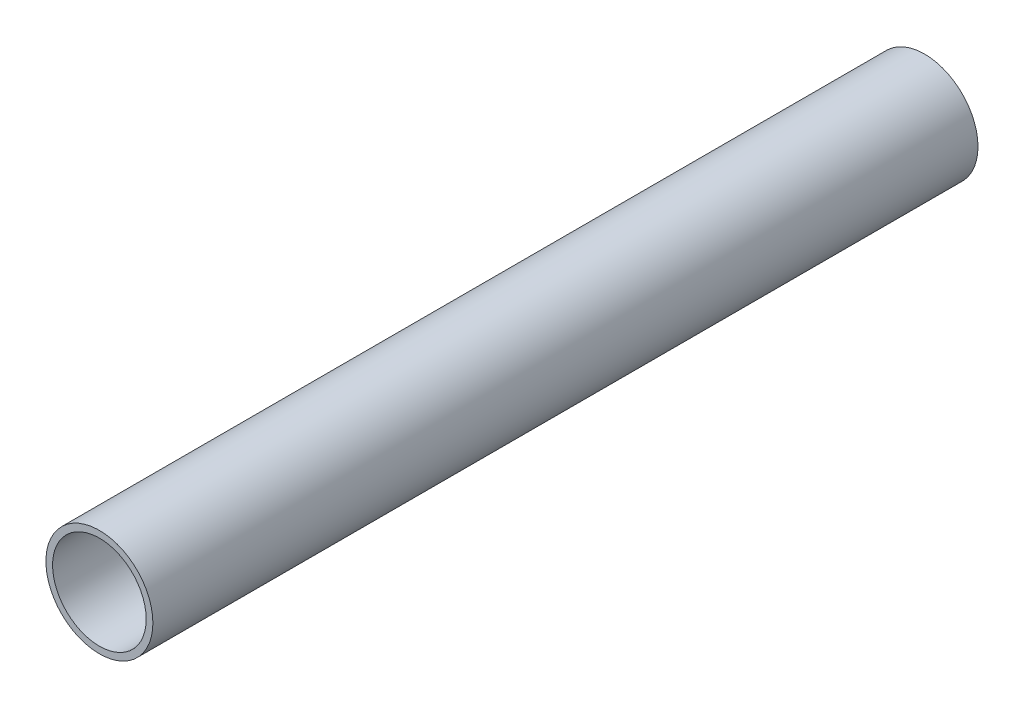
ISO-10303-21;
HEADER;
FILE_DESCRIPTION(('STEP AP214'),'2;1');
FILE_NAME('part.step','',(''),(''),'','','');
FILE_SCHEMA(('AUTOMOTIVE_DESIGN { 1 0 10303 214 1 1 1 1 }'));
ENDSEC;
DATA;
#1=APPLICATION_CONTEXT('core data for automotive mechanical design processes');
#2=APPLICATION_PROTOCOL_DEFINITION('international standard','automotive_design',2000,#1);
#3=PRODUCT_CONTEXT('',#1,'mechanical');
#4=PRODUCT('Part','Part','',(#3));
#5=PRODUCT_RELATED_PRODUCT_CATEGORY('part','',(#4));
#6=PRODUCT_DEFINITION_FORMATION('','',#4);
#7=PRODUCT_DEFINITION_CONTEXT('part definition',#1,'design');
#8=PRODUCT_DEFINITION('design','',#6,#7);
#9=PRODUCT_DEFINITION_SHAPE('','',#8);
#10=(LENGTH_UNIT() NAMED_UNIT(*) SI_UNIT(.MILLI.,.METRE.));
#11=(NAMED_UNIT(*) PLANE_ANGLE_UNIT() SI_UNIT($,.RADIAN.));
#12=(NAMED_UNIT(*) SI_UNIT($,.STERADIAN.) SOLID_ANGLE_UNIT());
#13=UNCERTAINTY_MEASURE_WITH_UNIT(LENGTH_MEASURE(1.E-05),#10,'distance_accuracy_value','');
#14=(GEOMETRIC_REPRESENTATION_CONTEXT(3) GLOBAL_UNCERTAINTY_ASSIGNED_CONTEXT((#13)) GLOBAL_UNIT_ASSIGNED_CONTEXT((#10,
#11,#12)) REPRESENTATION_CONTEXT('',''));
#15=CARTESIAN_POINT('',(0.,0.,0.));
#16=DIRECTION('',(0.,0.,1.));
#17=DIRECTION('',(1.,0.,0.));
#18=AXIS2_PLACEMENT_3D('',#15,#16,#17);
#19=CARTESIAN_POINT('',(0.,0.,123.4));
#20=DIRECTION('',(0.,0.,1.));
#21=DIRECTION('',(1.,0.,0.));
#22=AXIS2_PLACEMENT_3D('',#19,#20,#21);
#23=PLANE('',#22);
#24=CARTESIAN_POINT('',(0.,0.,123.4));
#25=DIRECTION('',(0.,0.,1.));
#26=DIRECTION('',(1.,0.,0.));
#27=AXIS2_PLACEMENT_3D('',#24,#25,#26);
#28=CIRCLE('',#27,16.);
#29=CARTESIAN_POINT('',(16.,0.,123.4));
#30=VERTEX_POINT('',#29);
#31=EDGE_CURVE('E11',#30,#30,#28,.T.);
#32=ORIENTED_EDGE('',*,*,#31,.T.);
#33=EDGE_LOOP('',(#32));
#34=FACE_BOUND('',#33,.T.);
#35=CARTESIAN_POINT('',(0.,0.,123.4));
#36=DIRECTION('',(0.,0.,1.));
#37=DIRECTION('',(1.,0.,0.));
#38=AXIS2_PLACEMENT_3D('',#35,#36,#37);
#39=CIRCLE('',#38,14.);
#40=CARTESIAN_POINT('',(14.,0.,123.4));
#41=VERTEX_POINT('',#40);
#42=EDGE_CURVE('E51',#41,#41,#39,.T.);
#43=ORIENTED_EDGE('',*,*,#42,.F.);
#44=EDGE_LOOP('',(#43));
#45=FACE_BOUND('',#44,.T.);
#46=ADVANCED_FACE('F40',(#34,#45),#23,.T.);
#47=CARTESIAN_POINT('',(0.,0.,-123.4));
#48=DIRECTION('',(0.,0.,1.));
#49=DIRECTION('',(1.,0.,0.));
#50=AXIS2_PLACEMENT_3D('',#47,#48,#49);
#51=PLANE('',#50);
#52=CARTESIAN_POINT('',(0.,0.,-123.4));
#53=DIRECTION('',(0.,0.,1.));
#54=DIRECTION('',(1.,0.,0.));
#55=AXIS2_PLACEMENT_3D('',#52,#53,#54);
#56=CIRCLE('',#55,16.);
#57=CARTESIAN_POINT('',(16.,0.,-123.4));
#58=VERTEX_POINT('',#57);
#59=EDGE_CURVE('E44',#58,#58,#56,.T.);
#60=ORIENTED_EDGE('',*,*,#59,.F.);
#61=EDGE_LOOP('',(#60));
#62=FACE_BOUND('',#61,.T.);
#63=CARTESIAN_POINT('',(0.,0.,-123.4));
#64=DIRECTION('',(0.,0.,1.));
#65=DIRECTION('',(1.,0.,0.));
#66=AXIS2_PLACEMENT_3D('',#63,#64,#65);
#67=CIRCLE('',#66,14.);
#68=CARTESIAN_POINT('',(14.,0.,-123.4));
#69=VERTEX_POINT('',#68);
#70=EDGE_CURVE('E53',#69,#69,#67,.T.);
#71=ORIENTED_EDGE('',*,*,#70,.T.);
#72=EDGE_LOOP('',(#71));
#73=FACE_BOUND('',#72,.T.);
#74=ADVANCED_FACE('F63',(#62,#73),#51,.F.);
#75=CARTESIAN_POINT('',(0.,0.,123.4));
#76=DIRECTION('',(0.,0.,-1.));
#77=DIRECTION('',(-1.,0.,0.));
#78=AXIS2_PLACEMENT_3D('',#75,#76,#77);
#79=CYLINDRICAL_SURFACE('',#78,16.);
#80=ORIENTED_EDGE('',*,*,#31,.F.);
#81=EDGE_LOOP('',(#80));
#82=FACE_BOUND('',#81,.T.);
#83=ORIENTED_EDGE('',*,*,#59,.T.);
#84=EDGE_LOOP('',(#83));
#85=FACE_BOUND('',#84,.T.);
#86=ADVANCED_FACE('F42',(#82,#85),#79,.T.);
#87=CARTESIAN_POINT('',(0.,0.,123.4));
#88=DIRECTION('',(0.,0.,-1.));
#89=DIRECTION('',(-1.,0.,0.));
#90=AXIS2_PLACEMENT_3D('',#87,#88,#89);
#91=CYLINDRICAL_SURFACE('',#90,14.);
#92=ORIENTED_EDGE('',*,*,#42,.T.);
#93=EDGE_LOOP('',(#92));
#94=FACE_BOUND('',#93,.T.);
#95=ORIENTED_EDGE('',*,*,#70,.F.);
#96=EDGE_LOOP('',(#95));
#97=FACE_BOUND('',#96,.T.);
#98=ADVANCED_FACE('F59',(#94,#97),#91,.F.);
#99=CLOSED_SHELL('',(#46,#74,#86,#98));
#100=MANIFOLD_SOLID_BREP('B2',#99);
#101=ADVANCED_BREP_SHAPE_REPRESENTATION('',(#18,#100),#14);
#102=SHAPE_DEFINITION_REPRESENTATION(#9,#101);
ENDSEC;
END-ISO-10303-21;
